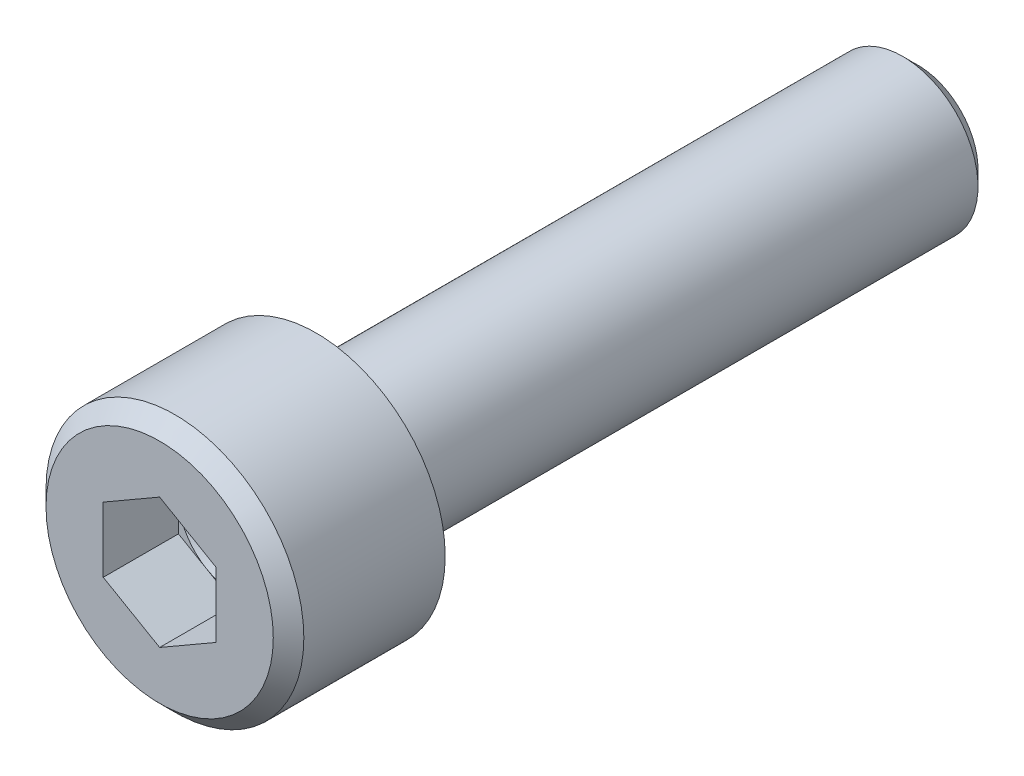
ISO-10303-21;
HEADER;
FILE_DESCRIPTION(('STEP AP214'),'2;1');
FILE_NAME('part.step','',(''),(''),'','','');
FILE_SCHEMA(('AUTOMOTIVE_DESIGN { 1 0 10303 214 1 1 1 1 }'));
ENDSEC;
DATA;
#1=APPLICATION_CONTEXT('core data for automotive mechanical design processes');
#2=APPLICATION_PROTOCOL_DEFINITION('international standard','automotive_design',2000,#1);
#3=PRODUCT_CONTEXT('',#1,'mechanical');
#4=PRODUCT('Part','Part','',(#3));
#5=PRODUCT_RELATED_PRODUCT_CATEGORY('part','',(#4));
#6=PRODUCT_DEFINITION_FORMATION('','',#4);
#7=PRODUCT_DEFINITION_CONTEXT('part definition',#1,'design');
#8=PRODUCT_DEFINITION('design','',#6,#7);
#9=PRODUCT_DEFINITION_SHAPE('','',#8);
#10=(LENGTH_UNIT() NAMED_UNIT(*) SI_UNIT(.MILLI.,.METRE.));
#11=(NAMED_UNIT(*) PLANE_ANGLE_UNIT() SI_UNIT($,.RADIAN.));
#12=(NAMED_UNIT(*) SI_UNIT($,.STERADIAN.) SOLID_ANGLE_UNIT());
#13=UNCERTAINTY_MEASURE_WITH_UNIT(LENGTH_MEASURE(1.E-05),#10,'distance_accuracy_value','');
#14=(GEOMETRIC_REPRESENTATION_CONTEXT(3) GLOBAL_UNCERTAINTY_ASSIGNED_CONTEXT((#13)) GLOBAL_UNIT_ASSIGNED_CONTEXT((#10,
#11,#12)) REPRESENTATION_CONTEXT('',''));
#15=CARTESIAN_POINT('',(0.,0.,0.));
#16=DIRECTION('',(0.,0.,1.));
#17=DIRECTION('',(1.,0.,0.));
#18=AXIS2_PLACEMENT_3D('',#15,#16,#17);
#19=CARTESIAN_POINT('',(-3.,0.,2.1656));
#20=DIRECTION('',(0.,0.,-1.));
#21=DIRECTION('',(-1.,0.,0.));
#22=AXIS2_PLACEMENT_3D('',#19,#20,#21);
#23=PLANE('',#22);
#24=CARTESIAN_POINT('',(0.,0.,2.1656));
#25=DIRECTION('',(0.,0.,1.));
#26=DIRECTION('',(1.,0.,0.));
#27=AXIS2_PLACEMENT_3D('',#24,#25,#26);
#28=CIRCLE('',#27,1.5);
#29=CARTESIAN_POINT('',(1.5,0.,2.1656));
#30=VERTEX_POINT('',#29);
#31=CARTESIAN_POINT('',(0.75,1.29903810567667,2.1656));
#32=VERTEX_POINT('',#31);
#33=EDGE_CURVE('E25',#30,#32,#28,.T.);
#34=ORIENTED_EDGE('',*,*,#33,.F.);
#35=DIRECTION('',(0.,1.,0.));
#36=VECTOR('',#35,1.);
#37=CARTESIAN_POINT('',(1.5,-0.866025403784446,2.1656));
#38=LINE('',#37,#36);
#39=CARTESIAN_POINT('',(1.5,0.866025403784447,2.1656));
#40=VERTEX_POINT('',#39);
#41=EDGE_CURVE('E116',#30,#40,#38,.T.);
#42=ORIENTED_EDGE('',*,*,#41,.T.);
#43=DIRECTION('',(-0.866025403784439,0.5,0.));
#44=VECTOR('',#43,1.);
#45=CARTESIAN_POINT('',(1.5,0.866025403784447,2.1656));
#46=LINE('',#45,#44);
#47=EDGE_CURVE('E112',#40,#32,#46,.T.);
#48=ORIENTED_EDGE('',*,*,#47,.T.);
#49=EDGE_LOOP('',(#34,#42,#48));
#50=FACE_BOUND('',#49,.T.);
#51=ADVANCED_FACE('F14',(#50),#23,.F.);
#52=CARTESIAN_POINT('',(-0.75,1.29903810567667,2.1656));
#53=VERTEX_POINT('',#52);
#54=EDGE_CURVE('E9',#32,#53,#28,.T.);
#55=ORIENTED_EDGE('',*,*,#54,.F.);
#56=CARTESIAN_POINT('',(0.,1.73205080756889,2.1656));
#57=VERTEX_POINT('',#56);
#58=EDGE_CURVE('E104',#32,#57,#46,.T.);
#59=ORIENTED_EDGE('',*,*,#58,.T.);
#60=DIRECTION('',(-0.866025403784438,-0.5,0.));
#61=VECTOR('',#60,1.);
#62=CARTESIAN_POINT('',(0.,1.73205080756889,2.1656));
#63=LINE('',#62,#61);
#64=EDGE_CURVE('E107',#57,#53,#63,.T.);
#65=ORIENTED_EDGE('',*,*,#64,.T.);
#66=EDGE_LOOP('',(#55,#59,#65));
#67=FACE_BOUND('',#66,.T.);
#68=ADVANCED_FACE('F103',(#67),#23,.F.);
#69=CARTESIAN_POINT('',(-1.5,0.,2.1656));
#70=VERTEX_POINT('',#69);
#71=EDGE_CURVE('E23',#53,#70,#28,.T.);
#72=ORIENTED_EDGE('',*,*,#71,.F.);
#73=CARTESIAN_POINT('',(-1.5,0.866025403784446,2.1656));
#74=VERTEX_POINT('',#73);
#75=EDGE_CURVE('E118',#53,#74,#63,.T.);
#76=ORIENTED_EDGE('',*,*,#75,.T.);
#77=DIRECTION('',(0.,-1.,0.));
#78=VECTOR('',#77,1.);
#79=CARTESIAN_POINT('',(-1.5,0.866025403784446,2.1656));
#80=LINE('',#79,#78);
#81=EDGE_CURVE('E124',#74,#70,#80,.T.);
#82=ORIENTED_EDGE('',*,*,#81,.T.);
#83=EDGE_LOOP('',(#72,#76,#82));
#84=FACE_BOUND('',#83,.T.);
#85=ADVANCED_FACE('F204',(#84),#23,.F.);
#86=CARTESIAN_POINT('',(-0.75,-1.29903810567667,2.1656));
#87=VERTEX_POINT('',#86);
#88=EDGE_CURVE('E156',#70,#87,#28,.T.);
#89=ORIENTED_EDGE('',*,*,#88,.F.);
#90=CARTESIAN_POINT('',(-1.5,-0.866025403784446,2.1656));
#91=VERTEX_POINT('',#90);
#92=EDGE_CURVE('E123',#70,#91,#80,.T.);
#93=ORIENTED_EDGE('',*,*,#92,.T.);
#94=DIRECTION('',(0.866025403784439,-0.5,0.));
#95=VECTOR('',#94,1.);
#96=CARTESIAN_POINT('',(-1.5,-0.866025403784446,2.1656));
#97=LINE('',#96,#95);
#98=EDGE_CURVE('E174',#91,#87,#97,.T.);
#99=ORIENTED_EDGE('',*,*,#98,.T.);
#100=EDGE_LOOP('',(#89,#93,#99));
#101=FACE_BOUND('',#100,.T.);
#102=ADVANCED_FACE('F212',(#101),#23,.F.);
#103=CARTESIAN_POINT('',(0.75,-1.29903810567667,2.1656));
#104=VERTEX_POINT('',#103);
#105=EDGE_CURVE('E32',#87,#104,#28,.T.);
#106=ORIENTED_EDGE('',*,*,#105,.F.);
#107=CARTESIAN_POINT('',(0.,-1.73205080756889,2.1656));
#108=VERTEX_POINT('',#107);
#109=EDGE_CURVE('E173',#87,#108,#97,.T.);
#110=ORIENTED_EDGE('',*,*,#109,.T.);
#111=DIRECTION('',(0.866025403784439,0.5,0.));
#112=VECTOR('',#111,1.);
#113=CARTESIAN_POINT('',(0.,-1.73205080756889,2.1656));
#114=LINE('',#113,#112);
#115=EDGE_CURVE('E177',#108,#104,#114,.T.);
#116=ORIENTED_EDGE('',*,*,#115,.T.);
#117=EDGE_LOOP('',(#106,#110,#116));
#118=FACE_BOUND('',#117,.T.);
#119=ADVANCED_FACE('F209',(#118),#23,.F.);
#120=EDGE_CURVE('E96',#104,#30,#28,.T.);
#121=ORIENTED_EDGE('',*,*,#120,.F.);
#122=CARTESIAN_POINT('',(1.5,-0.866025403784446,2.1656));
#123=VERTEX_POINT('',#122);
#124=EDGE_CURVE('E176',#104,#123,#114,.T.);
#125=ORIENTED_EDGE('',*,*,#124,.T.);
#126=EDGE_CURVE('E114',#123,#30,#38,.T.);
#127=ORIENTED_EDGE('',*,*,#126,.T.);
#128=EDGE_LOOP('',(#121,#125,#127));
#129=FACE_BOUND('',#128,.T.);
#130=ADVANCED_FACE('F185',(#129),#23,.F.);
#131=CARTESIAN_POINT('',(0.,3.429,0.));
#132=DIRECTION('',(0.,0.,-1.));
#133=DIRECTION('',(-1.,0.,0.));
#134=AXIS2_PLACEMENT_3D('',#131,#132,#133);
#135=PLANE('',#134);
#136=CARTESIAN_POINT('',(0.,0.,0.));
#137=DIRECTION('',(0.,0.,1.));
#138=DIRECTION('',(1.,0.,0.));
#139=AXIS2_PLACEMENT_3D('',#136,#137,#138);
#140=CIRCLE('',#139,3.429);
#141=CARTESIAN_POINT('',(3.429,0.,0.));
#142=VERTEX_POINT('',#141);
#143=EDGE_CURVE('E147',#142,#142,#140,.T.);
#144=ORIENTED_EDGE('',*,*,#143,.F.);
#145=EDGE_LOOP('',(#144));
#146=FACE_BOUND('',#145,.T.);
#147=CARTESIAN_POINT('',(0.,0.,0.));
#148=DIRECTION('',(0.,0.,-1.));
#149=DIRECTION('',(-1.,0.,0.));
#150=AXIS2_PLACEMENT_3D('',#147,#148,#149);
#151=CIRCLE('',#150,2.);
#152=CARTESIAN_POINT('',(-2.,0.,0.));
#153=VERTEX_POINT('',#152);
#154=EDGE_CURVE('E130',#153,#153,#151,.T.);
#155=ORIENTED_EDGE('',*,*,#154,.F.);
#156=EDGE_LOOP('',(#155));
#157=FACE_BOUND('',#156,.T.);
#158=ADVANCED_FACE('F16',(#146,#157),#135,.T.);
#159=CARTESIAN_POINT('',(0.,0.,4.1656));
#160=DIRECTION('',(0.,0.,1.));
#161=DIRECTION('',(1.,0.,0.));
#162=AXIS2_PLACEMENT_3D('',#159,#160,#161);
#163=PLANE('',#162);
#164=DIRECTION('',(0.866025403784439,-0.5,0.));
#165=VECTOR('',#164,1.);
#166=CARTESIAN_POINT('',(-1.5,-0.866025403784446,4.1656));
#167=LINE('',#166,#165);
#168=CARTESIAN_POINT('',(-1.5,-0.866025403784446,4.1656));
#169=VERTEX_POINT('',#168);
#170=CARTESIAN_POINT('',(0.,-1.73205080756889,4.1656));
#171=VERTEX_POINT('',#170);
#172=EDGE_CURVE('E40',#169,#171,#167,.T.);
#173=ORIENTED_EDGE('',*,*,#172,.F.);
#174=DIRECTION('',(0.,-1.,0.));
#175=VECTOR('',#174,1.);
#176=CARTESIAN_POINT('',(-1.5,0.866025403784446,4.1656));
#177=LINE('',#176,#175);
#178=CARTESIAN_POINT('',(-1.5,0.866025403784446,4.1656));
#179=VERTEX_POINT('',#178);
#180=EDGE_CURVE('E170',#179,#169,#177,.T.);
#181=ORIENTED_EDGE('',*,*,#180,.F.);
#182=DIRECTION('',(-0.866025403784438,-0.5,0.));
#183=VECTOR('',#182,1.);
#184=CARTESIAN_POINT('',(0.,1.73205080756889,4.1656));
#185=LINE('',#184,#183);
#186=CARTESIAN_POINT('',(0.,1.73205080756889,4.1656));
#187=VERTEX_POINT('',#186);
#188=EDGE_CURVE('E167',#187,#179,#185,.T.);
#189=ORIENTED_EDGE('',*,*,#188,.F.);
#190=DIRECTION('',(-0.866025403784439,0.5,0.));
#191=VECTOR('',#190,1.);
#192=CARTESIAN_POINT('',(1.5,0.866025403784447,4.1656));
#193=LINE('',#192,#191);
#194=CARTESIAN_POINT('',(1.5,0.866025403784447,4.1656));
#195=VERTEX_POINT('',#194);
#196=EDGE_CURVE('E165',#195,#187,#193,.T.);
#197=ORIENTED_EDGE('',*,*,#196,.F.);
#198=DIRECTION('',(0.,1.,0.));
#199=VECTOR('',#198,1.);
#200=CARTESIAN_POINT('',(1.5,-0.866025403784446,4.1656));
#201=LINE('',#200,#199);
#202=CARTESIAN_POINT('',(1.5,-0.866025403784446,4.1656));
#203=VERTEX_POINT('',#202);
#204=EDGE_CURVE('E162',#203,#195,#201,.T.);
#205=ORIENTED_EDGE('',*,*,#204,.F.);
#206=DIRECTION('',(0.866025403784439,0.5,0.));
#207=VECTOR('',#206,1.);
#208=CARTESIAN_POINT('',(0.,-1.73205080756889,4.1656));
#209=LINE('',#208,#207);
#210=EDGE_CURVE('E159',#171,#203,#209,.T.);
#211=ORIENTED_EDGE('',*,*,#210,.F.);
#212=EDGE_LOOP('',(#173,#181,#189,#197,#205,#211));
#213=FACE_BOUND('',#212,.T.);
#214=CARTESIAN_POINT('',(0.,0.,4.1656));
#215=DIRECTION('',(0.,0.,1.));
#216=DIRECTION('',(1.,0.,0.));
#217=AXIS2_PLACEMENT_3D('',#214,#215,#216);
#218=CIRCLE('',#217,3.0226);
#219=CARTESIAN_POINT('',(3.0226,0.,4.1656));
#220=VERTEX_POINT('',#219);
#221=EDGE_CURVE('E141',#220,#220,#218,.T.);
#222=ORIENTED_EDGE('',*,*,#221,.T.);
#223=EDGE_LOOP('',(#222));
#224=FACE_BOUND('',#223,.T.);
#225=ADVANCED_FACE('F196',(#213,#224),#163,.T.);
#226=CARTESIAN_POINT('',(0.,0.,35.9156));
#227=DIRECTION('',(0.,0.,1.));
#228=DIRECTION('',(1.,0.,0.));
#229=AXIS2_PLACEMENT_3D('',#226,#227,#228);
#230=CYLINDRICAL_SURFACE('',#229,3.429);
#231=ORIENTED_EDGE('',*,*,#143,.T.);
#232=EDGE_LOOP('',(#231));
#233=FACE_BOUND('',#232,.T.);
#234=CARTESIAN_POINT('',(0.,0.,3.7592));
#235=DIRECTION('',(0.,0.,1.));
#236=DIRECTION('',(1.,0.,0.));
#237=AXIS2_PLACEMENT_3D('',#234,#235,#236);
#238=CIRCLE('',#237,3.429);
#239=CARTESIAN_POINT('',(3.429,0.,3.7592));
#240=VERTEX_POINT('',#239);
#241=EDGE_CURVE('E144',#240,#240,#238,.T.);
#242=ORIENTED_EDGE('',*,*,#241,.F.);
#243=EDGE_LOOP('',(#242));
#244=FACE_BOUND('',#243,.T.);
#245=ADVANCED_FACE('F291',(#233,#244),#230,.T.);
#246=CARTESIAN_POINT('',(0.,0.,4.1656));
#247=DIRECTION('',(0.,0.,-1.));
#248=DIRECTION('',(-1.,0.,0.));
#249=AXIS2_PLACEMENT_3D('',#246,#247,#248);
#250=CONICAL_SURFACE('',#249,3.0226,0.785398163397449);
#251=ORIENTED_EDGE('',*,*,#241,.T.);
#252=EDGE_LOOP('',(#251));
#253=FACE_BOUND('',#252,.T.);
#254=ORIENTED_EDGE('',*,*,#221,.F.);
#255=EDGE_LOOP('',(#254));
#256=FACE_BOUND('',#255,.T.);
#257=ADVANCED_FACE('F298',(#253,#256),#250,.T.);
#258=CARTESIAN_POINT('',(0.,0.,-16.));
#259=DIRECTION('',(0.,0.,1.));
#260=DIRECTION('',(1.,0.,0.));
#261=AXIS2_PLACEMENT_3D('',#258,#259,#260);
#262=CYLINDRICAL_SURFACE('',#261,2.);
#263=CARTESIAN_POINT('',(0.,0.,-15.6));
#264=DIRECTION('',(0.,0.,-1.));
#265=DIRECTION('',(-1.,0.,0.));
#266=AXIS2_PLACEMENT_3D('',#263,#264,#265);
#267=CIRCLE('',#266,2.);
#268=CARTESIAN_POINT('',(-2.,0.,-15.6));
#269=VERTEX_POINT('',#268);
#270=EDGE_CURVE('E18',#269,#269,#267,.F.);
#271=ORIENTED_EDGE('',*,*,#270,.T.);
#272=EDGE_LOOP('',(#271));
#273=FACE_BOUND('',#272,.T.);
#274=ORIENTED_EDGE('',*,*,#154,.T.);
#275=EDGE_LOOP('',(#274));
#276=FACE_BOUND('',#275,.T.);
#277=ADVANCED_FACE('F306',(#273,#276),#262,.T.);
#278=CARTESIAN_POINT('',(0.,0.,-16.));
#279=DIRECTION('',(0.,0.,-1.));
#280=DIRECTION('',(-1.,0.,0.));
#281=AXIS2_PLACEMENT_3D('',#278,#279,#280);
#282=PLANE('',#281);
#283=CARTESIAN_POINT('',(0.,0.,-16.));
#284=DIRECTION('',(0.,0.,-1.));
#285=DIRECTION('',(-1.,0.,0.));
#286=AXIS2_PLACEMENT_3D('',#283,#284,#285);
#287=CIRCLE('',#286,1.6);
#288=CARTESIAN_POINT('',(-1.6,0.,-16.));
#289=VERTEX_POINT('',#288);
#290=EDGE_CURVE('E149',#289,#289,#287,.T.);
#291=ORIENTED_EDGE('',*,*,#290,.T.);
#292=EDGE_LOOP('',(#291));
#293=FACE_BOUND('',#292,.T.);
#294=ADVANCED_FACE('F315',(#293),#282,.T.);
#295=CARTESIAN_POINT('',(0.,0.,-16.));
#296=DIRECTION('',(0.,0.,1.));
#297=DIRECTION('',(1.,0.,0.));
#298=AXIS2_PLACEMENT_3D('',#295,#296,#297);
#299=CONICAL_SURFACE('',#298,1.6,0.785398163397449);
#300=ORIENTED_EDGE('',*,*,#270,.F.);
#301=EDGE_LOOP('',(#300));
#302=FACE_BOUND('',#301,.T.);
#303=ORIENTED_EDGE('',*,*,#290,.F.);
#304=EDGE_LOOP('',(#303));
#305=FACE_BOUND('',#304,.T.);
#306=ADVANCED_FACE('F225',(#302,#305),#299,.T.);
#307=CARTESIAN_POINT('',(-1.5,-0.866025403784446,2.1656));
#308=DIRECTION('',(-0.5,-0.866025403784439,0.));
#309=DIRECTION('',(-0.866025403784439,0.5,0.));
#310=AXIS2_PLACEMENT_3D('',#307,#308,#309);
#311=PLANE('',#310);
#312=ORIENTED_EDGE('',*,*,#172,.T.);
#313=DIRECTION('',(0.,0.,1.));
#314=VECTOR('',#313,1.);
#315=CARTESIAN_POINT('',(0.,-1.73205080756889,2.1656));
#316=LINE('',#315,#314);
#317=EDGE_CURVE('E127',#108,#171,#316,.T.);
#318=ORIENTED_EDGE('',*,*,#317,.F.);
#319=ORIENTED_EDGE('',*,*,#109,.F.);
#320=ORIENTED_EDGE('',*,*,#98,.F.);
#321=DIRECTION('',(0.,0.,1.));
#322=VECTOR('',#321,1.);
#323=CARTESIAN_POINT('',(-1.5,-0.866025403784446,2.1656));
#324=LINE('',#323,#322);
#325=EDGE_CURVE('E128',#91,#169,#324,.T.);
#326=ORIENTED_EDGE('',*,*,#325,.T.);
#327=EDGE_LOOP('',(#312,#318,#319,#320,#326));
#328=FACE_BOUND('',#327,.T.);
#329=ADVANCED_FACE('F211',(#328),#311,.F.);
#330=CARTESIAN_POINT('',(-1.5,0.866025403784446,2.1656));
#331=DIRECTION('',(-1.,0.,0.));
#332=DIRECTION('',(0.,0.,1.));
#333=AXIS2_PLACEMENT_3D('',#330,#331,#332);
#334=PLANE('',#333);
#335=ORIENTED_EDGE('',*,*,#180,.T.);
#336=ORIENTED_EDGE('',*,*,#325,.F.);
#337=ORIENTED_EDGE('',*,*,#92,.F.);
#338=ORIENTED_EDGE('',*,*,#81,.F.);
#339=DIRECTION('',(0.,0.,1.));
#340=VECTOR('',#339,1.);
#341=CARTESIAN_POINT('',(-1.5,0.866025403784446,2.1656));
#342=LINE('',#341,#340);
#343=EDGE_CURVE('E131',#74,#179,#342,.T.);
#344=ORIENTED_EDGE('',*,*,#343,.T.);
#345=EDGE_LOOP('',(#335,#336,#337,#338,#344));
#346=FACE_BOUND('',#345,.T.);
#347=ADVANCED_FACE('F215',(#346),#334,.F.);
#348=CARTESIAN_POINT('',(0.,1.73205080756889,2.1656));
#349=DIRECTION('',(-0.5,0.866025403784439,0.));
#350=DIRECTION('',(0.866025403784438,0.5,0.));
#351=AXIS2_PLACEMENT_3D('',#348,#349,#350);
#352=PLANE('',#351);
#353=ORIENTED_EDGE('',*,*,#188,.T.);
#354=ORIENTED_EDGE('',*,*,#343,.F.);
#355=ORIENTED_EDGE('',*,*,#75,.F.);
#356=ORIENTED_EDGE('',*,*,#64,.F.);
#357=DIRECTION('',(0.,0.,1.));
#358=VECTOR('',#357,1.);
#359=CARTESIAN_POINT('',(0.,1.73205080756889,2.1656));
#360=LINE('',#359,#358);
#361=EDGE_CURVE('E113',#57,#187,#360,.T.);
#362=ORIENTED_EDGE('',*,*,#361,.T.);
#363=EDGE_LOOP('',(#353,#354,#355,#356,#362));
#364=FACE_BOUND('',#363,.T.);
#365=ADVANCED_FACE('F200',(#364),#352,.F.);
#366=CARTESIAN_POINT('',(1.5,0.866025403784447,2.1656));
#367=DIRECTION('',(0.5,0.866025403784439,0.));
#368=DIRECTION('',(0.866025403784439,-0.5,0.));
#369=AXIS2_PLACEMENT_3D('',#366,#367,#368);
#370=PLANE('',#369);
#371=ORIENTED_EDGE('',*,*,#196,.T.);
#372=ORIENTED_EDGE('',*,*,#361,.F.);
#373=ORIENTED_EDGE('',*,*,#58,.F.);
#374=ORIENTED_EDGE('',*,*,#47,.F.);
#375=DIRECTION('',(0.,0.,1.));
#376=VECTOR('',#375,1.);
#377=CARTESIAN_POINT('',(1.5,0.866025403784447,2.1656));
#378=LINE('',#377,#376);
#379=EDGE_CURVE('E134',#40,#195,#378,.T.);
#380=ORIENTED_EDGE('',*,*,#379,.T.);
#381=EDGE_LOOP('',(#371,#372,#373,#374,#380));
#382=FACE_BOUND('',#381,.T.);
#383=ADVANCED_FACE('F111',(#382),#370,.F.);
#384=CARTESIAN_POINT('',(1.5,-0.866025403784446,2.1656));
#385=DIRECTION('',(1.,0.,0.));
#386=DIRECTION('',(0.,0.,-1.));
#387=AXIS2_PLACEMENT_3D('',#384,#385,#386);
#388=PLANE('',#387);
#389=ORIENTED_EDGE('',*,*,#204,.T.);
#390=ORIENTED_EDGE('',*,*,#379,.F.);
#391=ORIENTED_EDGE('',*,*,#41,.F.);
#392=ORIENTED_EDGE('',*,*,#126,.F.);
#393=DIRECTION('',(0.,0.,1.));
#394=VECTOR('',#393,1.);
#395=CARTESIAN_POINT('',(1.5,-0.866025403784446,2.1656));
#396=LINE('',#395,#394);
#397=EDGE_CURVE('E136',#123,#203,#396,.T.);
#398=ORIENTED_EDGE('',*,*,#397,.T.);
#399=EDGE_LOOP('',(#389,#390,#391,#392,#398));
#400=FACE_BOUND('',#399,.T.);
#401=ADVANCED_FACE('F191',(#400),#388,.F.);
#402=CARTESIAN_POINT('',(0.,-1.73205080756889,2.1656));
#403=DIRECTION('',(0.5,-0.866025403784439,0.));
#404=DIRECTION('',(-0.866025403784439,-0.5,0.));
#405=AXIS2_PLACEMENT_3D('',#402,#403,#404);
#406=PLANE('',#405);
#407=ORIENTED_EDGE('',*,*,#210,.T.);
#408=ORIENTED_EDGE('',*,*,#397,.F.);
#409=ORIENTED_EDGE('',*,*,#124,.F.);
#410=ORIENTED_EDGE('',*,*,#115,.F.);
#411=ORIENTED_EDGE('',*,*,#317,.T.);
#412=EDGE_LOOP('',(#407,#408,#409,#410,#411));
#413=FACE_BOUND('',#412,.T.);
#414=ADVANCED_FACE('F91',(#413),#406,.F.);
#415=CARTESIAN_POINT('',(0.,0.,2.1656));
#416=DIRECTION('',(0.,0.,1.));
#417=DIRECTION('',(1.,0.,0.));
#418=AXIS2_PLACEMENT_3D('',#415,#416,#417);
#419=CONICAL_SURFACE('',#418,1.5,1.0471975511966);
#420=CARTESIAN_POINT('',(0.,0.,1.29957459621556));
#421=VERTEX_POINT('',#420);
#422=VERTEX_LOOP('',#421);
#423=FACE_BOUND('',#422,.T.);
#424=ORIENTED_EDGE('',*,*,#33,.T.);
#425=ORIENTED_EDGE('',*,*,#54,.T.);
#426=ORIENTED_EDGE('',*,*,#71,.T.);
#427=ORIENTED_EDGE('',*,*,#88,.T.);
#428=ORIENTED_EDGE('',*,*,#105,.T.);
#429=ORIENTED_EDGE('',*,*,#120,.T.);
#430=EDGE_LOOP('',(#424,#425,#426,#427,#428,#429));
#431=FACE_BOUND('',#430,.T.);
#432=ADVANCED_FACE('F89',(#423,#431),#419,.F.);
#433=CLOSED_SHELL('',(#51,#68,#85,#102,#119,#130,#158,#225,#245,#257,#277,#294,#306,#329,#347,
#365,#383,#401,#414,#432));
#434=MANIFOLD_SOLID_BREP('B1',#433);
#435=ADVANCED_BREP_SHAPE_REPRESENTATION('',(#18,#434),#14);
#436=SHAPE_DEFINITION_REPRESENTATION(#9,#435);
ENDSEC;
END-ISO-10303-21;
